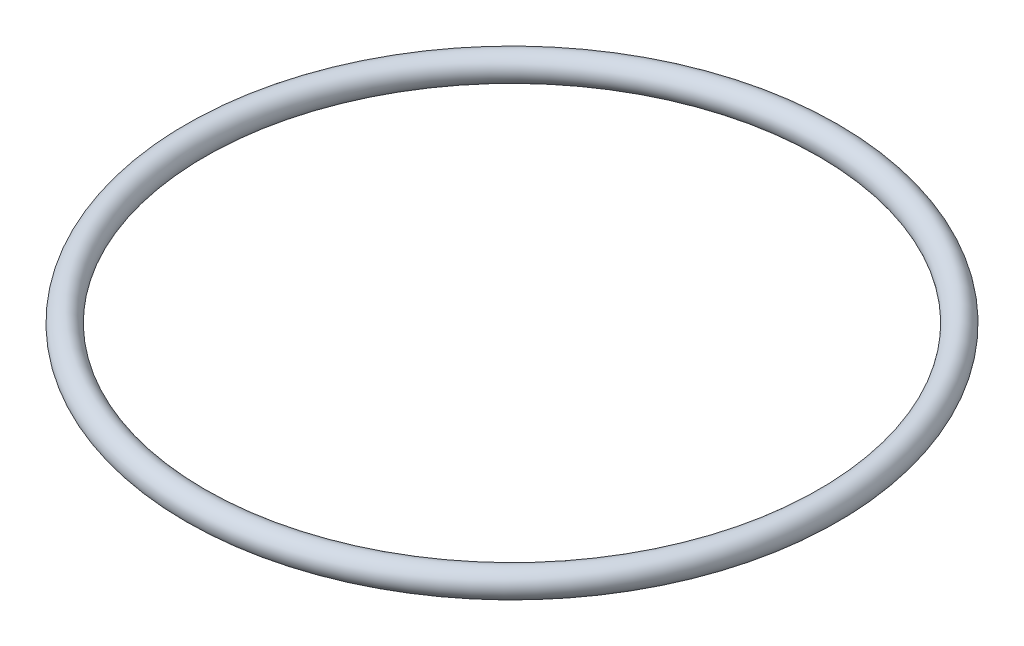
from build123d import *

# Parameters (mm, degrees)
SKETCH1_R = 1.3081


with BuildPart() as part:
    # Sketch1 → Revolve1 (revolve)
    with BuildSketch(Plane.XY, mode=Mode.PRIVATE) as revolve1_sk:
        with Locations((31.3055, 0)):
            Circle(SKETCH1_R)
    revolve(revolve1_sk.sketch.rotate(Axis((0, 0, 0), (0, 1, 0)), 90), axis=Axis((0, 0, 0), (0, 1, 0)))


solid = part.part
